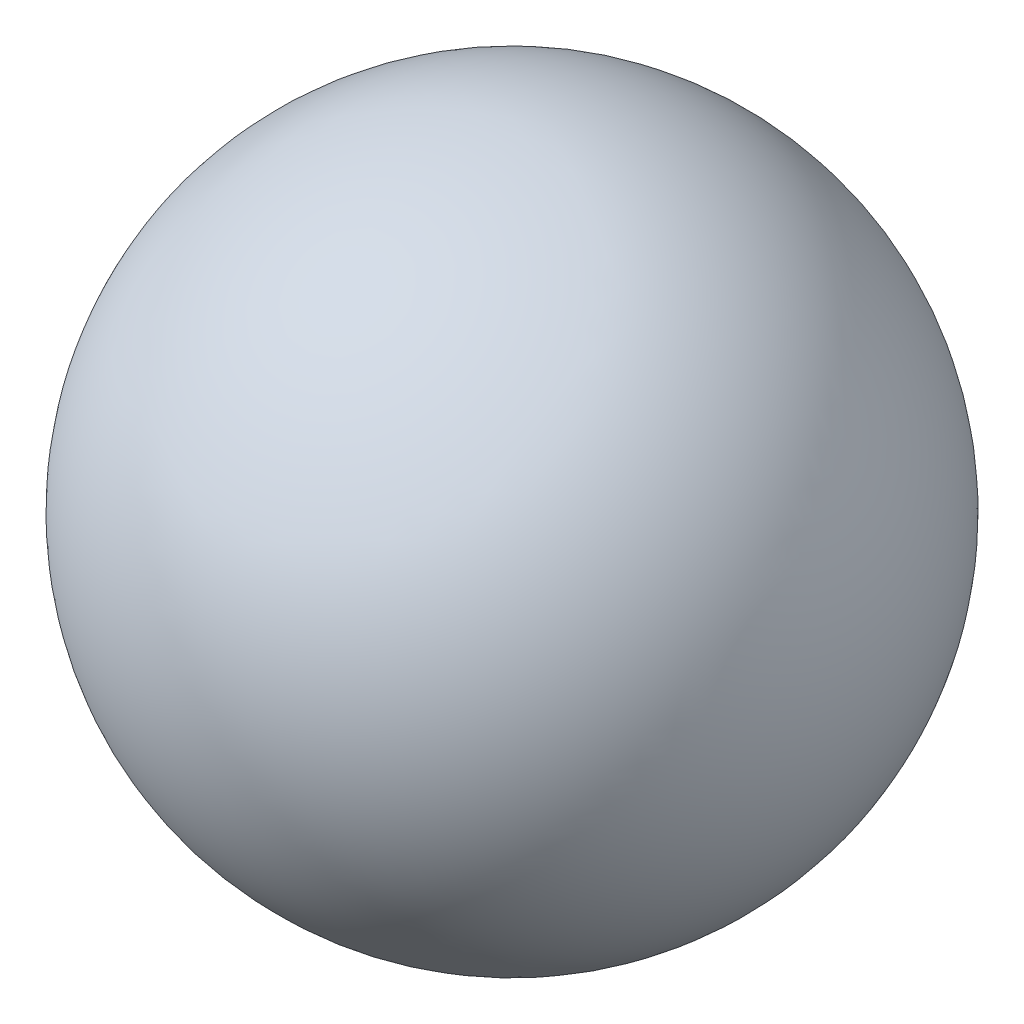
from build123d import *


with BuildPart() as part:
    # Esquisse1 → Base-R_volution (revolve)
    with BuildSketch(Plane(origin=(0, 0, 0), x_dir=(1, 0, 0), z_dir=(0, 1, 0))):
        with BuildLine():
            Line((1.25, 5.25), (8.75, 5.25))
            ThreePointArc((8.75, 5.25), (5, 9), (1.25, 5.25))
        make_face()
    revolve(axis=Axis((-1, 0, -5.25), (1, 0, 0)))


solid = part.part
